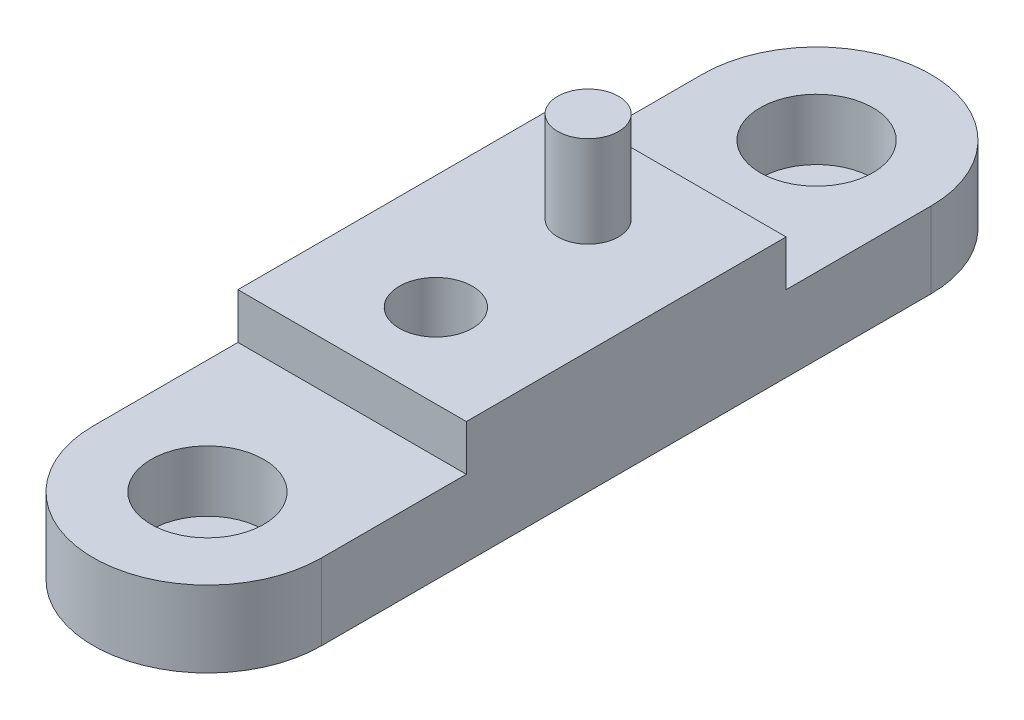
ISO-10303-21;
HEADER;
FILE_DESCRIPTION(('STEP AP214'),'2;1');
FILE_NAME('part.step','',(''),(''),'','','');
FILE_SCHEMA(('AUTOMOTIVE_DESIGN { 1 0 10303 214 1 1 1 1 }'));
ENDSEC;
DATA;
#1=APPLICATION_CONTEXT('core data for automotive mechanical design processes');
#2=APPLICATION_PROTOCOL_DEFINITION('international standard','automotive_design',2000,#1);
#3=PRODUCT_CONTEXT('',#1,'mechanical');
#4=PRODUCT('Part','Part','',(#3));
#5=PRODUCT_RELATED_PRODUCT_CATEGORY('part','',(#4));
#6=PRODUCT_DEFINITION_FORMATION('','',#4);
#7=PRODUCT_DEFINITION_CONTEXT('part definition',#1,'design');
#8=PRODUCT_DEFINITION('design','',#6,#7);
#9=PRODUCT_DEFINITION_SHAPE('','',#8);
#10=(LENGTH_UNIT() NAMED_UNIT(*) SI_UNIT(.MILLI.,.METRE.));
#11=(NAMED_UNIT(*) PLANE_ANGLE_UNIT() SI_UNIT($,.RADIAN.));
#12=(NAMED_UNIT(*) SI_UNIT($,.STERADIAN.) SOLID_ANGLE_UNIT());
#13=UNCERTAINTY_MEASURE_WITH_UNIT(LENGTH_MEASURE(1.E-05),#10,'distance_accuracy_value','');
#14=(GEOMETRIC_REPRESENTATION_CONTEXT(3) GLOBAL_UNCERTAINTY_ASSIGNED_CONTEXT((#13)) GLOBAL_UNIT_ASSIGNED_CONTEXT((#10,
#11,#12)) REPRESENTATION_CONTEXT('',''));
#15=CARTESIAN_POINT('',(0.,0.,0.));
#16=DIRECTION('',(0.,0.,1.));
#17=DIRECTION('',(1.,0.,0.));
#18=AXIS2_PLACEMENT_3D('',#15,#16,#17);
#19=CARTESIAN_POINT('',(0.,4.,0.));
#20=DIRECTION('',(0.,-1.,0.));
#21=DIRECTION('',(0.,0.,-1.));
#22=AXIS2_PLACEMENT_3D('',#19,#20,#21);
#23=CYLINDRICAL_SURFACE('',#22,3.75);
#24=CARTESIAN_POINT('',(0.,2.5,0.));
#25=DIRECTION('',(0.,1.,0.));
#26=DIRECTION('',(0.,0.,1.));
#27=AXIS2_PLACEMENT_3D('',#24,#25,#26);
#28=CIRCLE('',#27,3.75);
#29=CARTESIAN_POINT('',(3.75,2.5,0.));
#30=VERTEX_POINT('',#29);
#31=CARTESIAN_POINT('',(-3.75,2.5,0.));
#32=VERTEX_POINT('',#31);
#33=EDGE_CURVE('E159',#30,#32,#28,.T.);
#34=ORIENTED_EDGE('',*,*,#33,.F.);
#35=DIRECTION('',(0.,-1.,0.));
#36=VECTOR('',#35,1.);
#37=CARTESIAN_POINT('',(3.75,4.,0.));
#38=LINE('',#37,#36);
#39=CARTESIAN_POINT('',(3.75,0.,0.));
#40=VERTEX_POINT('',#39);
#41=EDGE_CURVE('E44',#30,#40,#38,.T.);
#42=ORIENTED_EDGE('',*,*,#41,.T.);
#43=CARTESIAN_POINT('',(0.,0.,0.));
#44=DIRECTION('',(0.,1.,0.));
#45=DIRECTION('',(0.,0.,1.));
#46=AXIS2_PLACEMENT_3D('',#43,#44,#45);
#47=CIRCLE('',#46,3.75);
#48=CARTESIAN_POINT('',(-3.75,0.,0.));
#49=VERTEX_POINT('',#48);
#50=EDGE_CURVE('E165',#40,#49,#47,.T.);
#51=ORIENTED_EDGE('',*,*,#50,.T.);
#52=DIRECTION('',(0.,-1.,0.));
#53=VECTOR('',#52,1.);
#54=CARTESIAN_POINT('',(-3.75,4.,0.));
#55=LINE('',#54,#53);
#56=EDGE_CURVE('E11',#32,#49,#55,.T.);
#57=ORIENTED_EDGE('',*,*,#56,.F.);
#58=EDGE_LOOP('',(#34,#42,#51,#57));
#59=FACE_BOUND('',#58,.T.);
#60=ADVANCED_FACE('F37',(#59),#23,.T.);
#61=CARTESIAN_POINT('',(-3.75,4.,0.));
#62=DIRECTION('',(1.,0.,0.));
#63=DIRECTION('',(0.,0.,-1.));
#64=AXIS2_PLACEMENT_3D('',#61,#62,#63);
#65=PLANE('',#64);
#66=DIRECTION('',(0.,0.,1.));
#67=VECTOR('',#66,1.);
#68=CARTESIAN_POINT('',(-3.75,4.,0.));
#69=LINE('',#68,#67);
#70=CARTESIAN_POINT('',(-3.75,4.,4.75));
#71=VERTEX_POINT('',#70);
#72=CARTESIAN_POINT('',(-3.75,4.,15.25));
#73=VERTEX_POINT('',#72);
#74=EDGE_CURVE('E167',#71,#73,#69,.T.);
#75=ORIENTED_EDGE('',*,*,#74,.F.);
#76=DIRECTION('',(0.,1.,0.));
#77=VECTOR('',#76,1.);
#78=CARTESIAN_POINT('',(-3.75,2.5,4.75));
#79=LINE('',#78,#77);
#80=CARTESIAN_POINT('',(-3.75,2.5,4.75));
#81=VERTEX_POINT('',#80);
#82=EDGE_CURVE('E51',#81,#71,#79,.T.);
#83=ORIENTED_EDGE('',*,*,#82,.F.);
#84=DIRECTION('',(0.,0.,1.));
#85=VECTOR('',#84,1.);
#86=CARTESIAN_POINT('',(-3.75,2.5,0.));
#87=LINE('',#86,#85);
#88=EDGE_CURVE('E151',#32,#81,#87,.T.);
#89=ORIENTED_EDGE('',*,*,#88,.F.);
#90=ORIENTED_EDGE('',*,*,#56,.T.);
#91=DIRECTION('',(0.,0.,1.));
#92=VECTOR('',#91,1.);
#93=CARTESIAN_POINT('',(-3.75,0.,0.));
#94=LINE('',#93,#92);
#95=CARTESIAN_POINT('',(-3.75,0.,20.));
#96=VERTEX_POINT('',#95);
#97=EDGE_CURVE('E174',#49,#96,#94,.T.);
#98=ORIENTED_EDGE('',*,*,#97,.T.);
#99=DIRECTION('',(0.,-1.,0.));
#100=VECTOR('',#99,1.);
#101=CARTESIAN_POINT('',(-3.75,4.,20.));
#102=LINE('',#101,#100);
#103=CARTESIAN_POINT('',(-3.75,2.5,20.));
#104=VERTEX_POINT('',#103);
#105=EDGE_CURVE('E125',#104,#96,#102,.T.);
#106=ORIENTED_EDGE('',*,*,#105,.F.);
#107=DIRECTION('',(0.,0.,-1.));
#108=VECTOR('',#107,1.);
#109=CARTESIAN_POINT('',(-3.75,2.5,20.));
#110=LINE('',#109,#108);
#111=CARTESIAN_POINT('',(-3.75,2.5,15.25));
#112=VERTEX_POINT('',#111);
#113=EDGE_CURVE('E105',#104,#112,#110,.T.);
#114=ORIENTED_EDGE('',*,*,#113,.T.);
#115=DIRECTION('',(0.,1.,0.));
#116=VECTOR('',#115,1.);
#117=CARTESIAN_POINT('',(-3.75,2.5,15.25));
#118=LINE('',#117,#116);
#119=EDGE_CURVE('E114',#112,#73,#118,.T.);
#120=ORIENTED_EDGE('',*,*,#119,.T.);
#121=EDGE_LOOP('',(#75,#83,#89,#90,#98,#106,#114,#120));
#122=FACE_BOUND('',#121,.T.);
#123=ADVANCED_FACE('F123',(#122),#65,.F.);
#124=CARTESIAN_POINT('',(3.75,4.,0.));
#125=DIRECTION('',(-1.,0.,0.));
#126=DIRECTION('',(0.,0.,1.));
#127=AXIS2_PLACEMENT_3D('',#124,#125,#126);
#128=PLANE('',#127);
#129=DIRECTION('',(0.,0.,-1.));
#130=VECTOR('',#129,1.);
#131=CARTESIAN_POINT('',(3.75,2.5,0.));
#132=LINE('',#131,#130);
#133=CARTESIAN_POINT('',(3.75,2.5,4.75));
#134=VERTEX_POINT('',#133);
#135=EDGE_CURVE('E157',#134,#30,#132,.T.);
#136=ORIENTED_EDGE('',*,*,#135,.F.);
#137=DIRECTION('',(0.,1.,0.));
#138=VECTOR('',#137,1.);
#139=CARTESIAN_POINT('',(3.75,2.5,4.75));
#140=LINE('',#139,#138);
#141=CARTESIAN_POINT('',(3.75,4.,4.75));
#142=VERTEX_POINT('',#141);
#143=EDGE_CURVE('E162',#134,#142,#140,.T.);
#144=ORIENTED_EDGE('',*,*,#143,.T.);
#145=DIRECTION('',(0.,0.,-1.));
#146=VECTOR('',#145,1.);
#147=CARTESIAN_POINT('',(3.75,4.,0.));
#148=LINE('',#147,#146);
#149=CARTESIAN_POINT('',(3.75,4.,15.25));
#150=VERTEX_POINT('',#149);
#151=EDGE_CURVE('E169',#150,#142,#148,.T.);
#152=ORIENTED_EDGE('',*,*,#151,.F.);
#153=DIRECTION('',(0.,1.,0.));
#154=VECTOR('',#153,1.);
#155=CARTESIAN_POINT('',(3.75,2.5,15.25));
#156=LINE('',#155,#154);
#157=CARTESIAN_POINT('',(3.75,2.5,15.25));
#158=VERTEX_POINT('',#157);
#159=EDGE_CURVE('E120',#158,#150,#156,.T.);
#160=ORIENTED_EDGE('',*,*,#159,.F.);
#161=DIRECTION('',(0.,0.,1.));
#162=VECTOR('',#161,1.);
#163=CARTESIAN_POINT('',(3.75,2.5,20.));
#164=LINE('',#163,#162);
#165=CARTESIAN_POINT('',(3.75,2.5,20.));
#166=VERTEX_POINT('',#165);
#167=EDGE_CURVE('E107',#158,#166,#164,.T.);
#168=ORIENTED_EDGE('',*,*,#167,.T.);
#169=DIRECTION('',(0.,-1.,0.));
#170=VECTOR('',#169,1.);
#171=CARTESIAN_POINT('',(3.75,4.,20.));
#172=LINE('',#171,#170);
#173=CARTESIAN_POINT('',(3.75,0.,20.));
#174=VERTEX_POINT('',#173);
#175=EDGE_CURVE('E140',#166,#174,#172,.T.);
#176=ORIENTED_EDGE('',*,*,#175,.T.);
#177=DIRECTION('',(0.,0.,-1.));
#178=VECTOR('',#177,1.);
#179=CARTESIAN_POINT('',(3.75,0.,0.));
#180=LINE('',#179,#178);
#181=EDGE_CURVE('E170',#174,#40,#180,.T.);
#182=ORIENTED_EDGE('',*,*,#181,.T.);
#183=ORIENTED_EDGE('',*,*,#41,.F.);
#184=EDGE_LOOP('',(#136,#144,#152,#160,#168,#176,#182,#183));
#185=FACE_BOUND('',#184,.T.);
#186=ADVANCED_FACE('F179',(#185),#128,.F.);
#187=CARTESIAN_POINT('',(0.,4.,0.));
#188=DIRECTION('',(0.,1.,0.));
#189=DIRECTION('',(0.,0.,1.));
#190=AXIS2_PLACEMENT_3D('',#187,#188,#189);
#191=PLANE('',#190);
#192=CARTESIAN_POINT('',(0.,4.,12.5));
#193=DIRECTION('',(0.,1.,0.));
#194=DIRECTION('',(0.,0.,1.));
#195=AXIS2_PLACEMENT_3D('',#192,#193,#194);
#196=CIRCLE('',#195,1.2);
#197=CARTESIAN_POINT('',(0.,4.,13.7));
#198=VERTEX_POINT('',#197);
#199=EDGE_CURVE('E350',#198,#198,#196,.T.);
#200=ORIENTED_EDGE('',*,*,#199,.F.);
#201=EDGE_LOOP('',(#200));
#202=FACE_BOUND('',#201,.T.);
#203=CARTESIAN_POINT('',(0.,4.,7.5));
#204=DIRECTION('',(0.,1.,0.));
#205=DIRECTION('',(0.,0.,1.));
#206=AXIS2_PLACEMENT_3D('',#203,#204,#205);
#207=CIRCLE('',#206,1.);
#208=CARTESIAN_POINT('',(0.,4.,8.5));
#209=VERTEX_POINT('',#208);
#210=EDGE_CURVE('E352',#209,#209,#207,.T.);
#211=ORIENTED_EDGE('',*,*,#210,.F.);
#212=EDGE_LOOP('',(#211));
#213=FACE_BOUND('',#212,.T.);
#214=DIRECTION('',(1.,0.,0.));
#215=VECTOR('',#214,1.);
#216=CARTESIAN_POINT('',(-3.75,4.,4.75));
#217=LINE('',#216,#215);
#218=EDGE_CURVE('E148',#71,#142,#217,.T.);
#219=ORIENTED_EDGE('',*,*,#218,.F.);
#220=ORIENTED_EDGE('',*,*,#74,.T.);
#221=DIRECTION('',(1.,0.,0.));
#222=VECTOR('',#221,1.);
#223=CARTESIAN_POINT('',(-3.75,4.,15.25));
#224=LINE('',#223,#222);
#225=EDGE_CURVE('E117',#73,#150,#224,.T.);
#226=ORIENTED_EDGE('',*,*,#225,.T.);
#227=ORIENTED_EDGE('',*,*,#151,.T.);
#228=EDGE_LOOP('',(#219,#220,#226,#227));
#229=FACE_BOUND('',#228,.T.);
#230=ADVANCED_FACE('F190',(#202,#213,#229),#191,.T.);
#231=CARTESIAN_POINT('',(0.,0.,0.));
#232=DIRECTION('',(0.,1.,0.));
#233=DIRECTION('',(0.,0.,1.));
#234=AXIS2_PLACEMENT_3D('',#231,#232,#233);
#235=PLANE('',#234);
#236=CARTESIAN_POINT('',(0.,0.,12.5));
#237=DIRECTION('',(0.,1.,0.));
#238=DIRECTION('',(0.,0.,1.));
#239=AXIS2_PLACEMENT_3D('',#236,#237,#238);
#240=CIRCLE('',#239,1.2);
#241=CARTESIAN_POINT('',(0.,0.,13.7));
#242=VERTEX_POINT('',#241);
#243=EDGE_CURVE('E347',#242,#242,#240,.T.);
#244=ORIENTED_EDGE('',*,*,#243,.T.);
#245=EDGE_LOOP('',(#244));
#246=FACE_BOUND('',#245,.T.);
#247=ORIENTED_EDGE('',*,*,#50,.F.);
#248=ORIENTED_EDGE('',*,*,#181,.F.);
#249=CARTESIAN_POINT('',(0.,0.,20.));
#250=DIRECTION('',(0.,-1.,0.));
#251=DIRECTION('',(0.,0.,-1.));
#252=AXIS2_PLACEMENT_3D('',#249,#250,#251);
#253=CIRCLE('',#252,3.75);
#254=EDGE_CURVE('E136',#174,#96,#253,.T.);
#255=ORIENTED_EDGE('',*,*,#254,.T.);
#256=ORIENTED_EDGE('',*,*,#97,.F.);
#257=EDGE_LOOP('',(#247,#248,#255,#256));
#258=FACE_BOUND('',#257,.T.);
#259=ADVANCED_FACE('F184',(#246,#258),#235,.F.);
#260=CARTESIAN_POINT('',(-3.75,2.5,4.75));
#261=DIRECTION('',(0.,0.,1.));
#262=DIRECTION('',(1.,0.,0.));
#263=AXIS2_PLACEMENT_3D('',#260,#261,#262);
#264=PLANE('',#263);
#265=ORIENTED_EDGE('',*,*,#218,.T.);
#266=ORIENTED_EDGE('',*,*,#143,.F.);
#267=DIRECTION('',(1.,0.,0.));
#268=VECTOR('',#267,1.);
#269=CARTESIAN_POINT('',(-3.75,2.5,4.75));
#270=LINE('',#269,#268);
#271=EDGE_CURVE('E154',#81,#134,#270,.T.);
#272=ORIENTED_EDGE('',*,*,#271,.F.);
#273=ORIENTED_EDGE('',*,*,#82,.T.);
#274=EDGE_LOOP('',(#265,#266,#272,#273));
#275=FACE_BOUND('',#274,.T.);
#276=ADVANCED_FACE('F215',(#275),#264,.F.);
#277=CARTESIAN_POINT('',(0.,2.5,0.));
#278=DIRECTION('',(0.,1.,0.));
#279=DIRECTION('',(0.,0.,1.));
#280=AXIS2_PLACEMENT_3D('',#277,#278,#279);
#281=PLANE('',#280);
#282=CARTESIAN_POINT('',(0.,2.5,0.));
#283=DIRECTION('',(0.,1.,0.));
#284=DIRECTION('',(0.,0.,1.));
#285=AXIS2_PLACEMENT_3D('',#282,#283,#284);
#286=CIRCLE('',#285,1.85);
#287=CARTESIAN_POINT('',(0.,2.5,1.85));
#288=VERTEX_POINT('',#287);
#289=EDGE_CURVE('E144',#288,#288,#286,.T.);
#290=ORIENTED_EDGE('',*,*,#289,.F.);
#291=EDGE_LOOP('',(#290));
#292=FACE_BOUND('',#291,.T.);
#293=ORIENTED_EDGE('',*,*,#88,.T.);
#294=ORIENTED_EDGE('',*,*,#271,.T.);
#295=ORIENTED_EDGE('',*,*,#135,.T.);
#296=ORIENTED_EDGE('',*,*,#33,.T.);
#297=EDGE_LOOP('',(#293,#294,#295,#296));
#298=FACE_BOUND('',#297,.T.);
#299=ADVANCED_FACE('F188',(#292,#298),#281,.T.);
#300=CARTESIAN_POINT('',(0.,0.5,0.));
#301=DIRECTION('',(0.,1.,0.));
#302=DIRECTION('',(0.,0.,1.));
#303=AXIS2_PLACEMENT_3D('',#300,#301,#302);
#304=CYLINDRICAL_SURFACE('',#303,1.85);
#305=CARTESIAN_POINT('',(0.,0.5,0.));
#306=DIRECTION('',(0.,1.,0.));
#307=DIRECTION('',(0.,0.,1.));
#308=AXIS2_PLACEMENT_3D('',#305,#306,#307);
#309=CIRCLE('',#308,1.85);
#310=CARTESIAN_POINT('',(0.,0.5,1.85));
#311=VERTEX_POINT('',#310);
#312=EDGE_CURVE('E145',#311,#311,#309,.T.);
#313=ORIENTED_EDGE('',*,*,#312,.F.);
#314=EDGE_LOOP('',(#313));
#315=FACE_BOUND('',#314,.T.);
#316=ORIENTED_EDGE('',*,*,#289,.T.);
#317=EDGE_LOOP('',(#316));
#318=FACE_BOUND('',#317,.T.);
#319=ADVANCED_FACE('F201',(#315,#318),#304,.F.);
#320=CARTESIAN_POINT('',(0.,0.5,0.));
#321=DIRECTION('',(0.,1.,0.));
#322=DIRECTION('',(0.,0.,1.));
#323=AXIS2_PLACEMENT_3D('',#320,#321,#322);
#324=PLANE('',#323);
#325=ORIENTED_EDGE('',*,*,#312,.T.);
#326=EDGE_LOOP('',(#325));
#327=FACE_BOUND('',#326,.T.);
#328=ADVANCED_FACE('F194',(#327),#324,.T.);
#329=CARTESIAN_POINT('',(0.,4.,20.));
#330=DIRECTION('',(0.,-1.,0.));
#331=DIRECTION('',(0.,0.,1.));
#332=AXIS2_PLACEMENT_3D('',#329,#330,#331);
#333=CYLINDRICAL_SURFACE('',#332,3.75);
#334=CARTESIAN_POINT('',(0.,2.5,20.));
#335=DIRECTION('',(0.,-1.,0.));
#336=DIRECTION('',(0.,0.,-1.));
#337=AXIS2_PLACEMENT_3D('',#334,#335,#336);
#338=CIRCLE('',#337,3.75);
#339=EDGE_CURVE('E121',#166,#104,#338,.T.);
#340=ORIENTED_EDGE('',*,*,#339,.T.);
#341=ORIENTED_EDGE('',*,*,#105,.T.);
#342=ORIENTED_EDGE('',*,*,#254,.F.);
#343=ORIENTED_EDGE('',*,*,#175,.F.);
#344=EDGE_LOOP('',(#340,#341,#342,#343));
#345=FACE_BOUND('',#344,.T.);
#346=ADVANCED_FACE('F192',(#345),#333,.T.);
#347=CARTESIAN_POINT('',(-3.75,2.5,15.25));
#348=DIRECTION('',(0.,0.,-1.));
#349=DIRECTION('',(1.,0.,0.));
#350=AXIS2_PLACEMENT_3D('',#347,#348,#349);
#351=PLANE('',#350);
#352=ORIENTED_EDGE('',*,*,#225,.F.);
#353=ORIENTED_EDGE('',*,*,#119,.F.);
#354=DIRECTION('',(1.,0.,0.));
#355=VECTOR('',#354,1.);
#356=CARTESIAN_POINT('',(-3.75,2.5,15.25));
#357=LINE('',#356,#355);
#358=EDGE_CURVE('E100',#112,#158,#357,.T.);
#359=ORIENTED_EDGE('',*,*,#358,.T.);
#360=ORIENTED_EDGE('',*,*,#159,.T.);
#361=EDGE_LOOP('',(#352,#353,#359,#360));
#362=FACE_BOUND('',#361,.T.);
#363=ADVANCED_FACE('F115',(#362),#351,.F.);
#364=CARTESIAN_POINT('',(0.,2.5,20.));
#365=DIRECTION('',(0.,1.,0.));
#366=DIRECTION('',(0.,0.,-1.));
#367=AXIS2_PLACEMENT_3D('',#364,#365,#366);
#368=PLANE('',#367);
#369=CARTESIAN_POINT('',(0.,2.5,20.));
#370=DIRECTION('',(0.,-1.,0.));
#371=DIRECTION('',(0.,0.,-1.));
#372=AXIS2_PLACEMENT_3D('',#369,#370,#371);
#373=CIRCLE('',#372,1.85);
#374=CARTESIAN_POINT('',(0.,2.5,18.15));
#375=VERTEX_POINT('',#374);
#376=EDGE_CURVE('E131',#375,#375,#373,.T.);
#377=ORIENTED_EDGE('',*,*,#376,.T.);
#378=EDGE_LOOP('',(#377));
#379=FACE_BOUND('',#378,.T.);
#380=ORIENTED_EDGE('',*,*,#113,.F.);
#381=ORIENTED_EDGE('',*,*,#339,.F.);
#382=ORIENTED_EDGE('',*,*,#167,.F.);
#383=ORIENTED_EDGE('',*,*,#358,.F.);
#384=EDGE_LOOP('',(#380,#381,#382,#383));
#385=FACE_BOUND('',#384,.T.);
#386=ADVANCED_FACE('F102',(#379,#385),#368,.T.);
#387=CARTESIAN_POINT('',(0.,0.5,20.));
#388=DIRECTION('',(0.,1.,0.));
#389=DIRECTION('',(0.,0.,-1.));
#390=AXIS2_PLACEMENT_3D('',#387,#388,#389);
#391=CYLINDRICAL_SURFACE('',#390,1.85);
#392=CARTESIAN_POINT('',(0.,0.5,20.));
#393=DIRECTION('',(0.,-1.,0.));
#394=DIRECTION('',(0.,0.,-1.));
#395=AXIS2_PLACEMENT_3D('',#392,#393,#394);
#396=CIRCLE('',#395,1.85);
#397=CARTESIAN_POINT('',(0.,0.5,18.15));
#398=VERTEX_POINT('',#397);
#399=EDGE_CURVE('E128',#398,#398,#396,.T.);
#400=ORIENTED_EDGE('',*,*,#399,.T.);
#401=EDGE_LOOP('',(#400));
#402=FACE_BOUND('',#401,.T.);
#403=ORIENTED_EDGE('',*,*,#376,.F.);
#404=EDGE_LOOP('',(#403));
#405=FACE_BOUND('',#404,.T.);
#406=ADVANCED_FACE('F292',(#402,#405),#391,.F.);
#407=CARTESIAN_POINT('',(0.,0.5,20.));
#408=DIRECTION('',(0.,1.,0.));
#409=DIRECTION('',(0.,0.,-1.));
#410=AXIS2_PLACEMENT_3D('',#407,#408,#409);
#411=PLANE('',#410);
#412=ORIENTED_EDGE('',*,*,#399,.F.);
#413=EDGE_LOOP('',(#412));
#414=FACE_BOUND('',#413,.T.);
#415=ADVANCED_FACE('F301',(#414),#411,.T.);
#416=CARTESIAN_POINT('',(0.,7.,7.5));
#417=DIRECTION('',(0.,-1.,0.));
#418=DIRECTION('',(0.,0.,-1.));
#419=AXIS2_PLACEMENT_3D('',#416,#417,#418);
#420=CYLINDRICAL_SURFACE('',#419,1.);
#421=CARTESIAN_POINT('',(0.,7.,7.5));
#422=DIRECTION('',(0.,1.,0.));
#423=DIRECTION('',(0.,0.,1.));
#424=AXIS2_PLACEMENT_3D('',#421,#422,#423);
#425=CIRCLE('',#424,1.);
#426=CARTESIAN_POINT('',(0.,7.,8.5));
#427=VERTEX_POINT('',#426);
#428=EDGE_CURVE('E355',#427,#427,#425,.T.);
#429=ORIENTED_EDGE('',*,*,#428,.F.);
#430=EDGE_LOOP('',(#429));
#431=FACE_BOUND('',#430,.T.);
#432=ORIENTED_EDGE('',*,*,#210,.T.);
#433=EDGE_LOOP('',(#432));
#434=FACE_BOUND('',#433,.T.);
#435=ADVANCED_FACE('F310',(#431,#434),#420,.T.);
#436=CARTESIAN_POINT('',(0.,7.,7.5));
#437=DIRECTION('',(0.,1.,0.));
#438=DIRECTION('',(0.,0.,1.));
#439=AXIS2_PLACEMENT_3D('',#436,#437,#438);
#440=PLANE('',#439);
#441=ORIENTED_EDGE('',*,*,#428,.T.);
#442=EDGE_LOOP('',(#441));
#443=FACE_BOUND('',#442,.T.);
#444=ADVANCED_FACE('F319',(#443),#440,.T.);
#445=CARTESIAN_POINT('',(0.,0.,12.5));
#446=DIRECTION('',(0.,1.,0.));
#447=DIRECTION('',(0.,0.,1.));
#448=AXIS2_PLACEMENT_3D('',#445,#446,#447);
#449=CYLINDRICAL_SURFACE('',#448,1.2);
#450=ORIENTED_EDGE('',*,*,#243,.F.);
#451=EDGE_LOOP('',(#450));
#452=FACE_BOUND('',#451,.T.);
#453=ORIENTED_EDGE('',*,*,#199,.T.);
#454=EDGE_LOOP('',(#453));
#455=FACE_BOUND('',#454,.T.);
#456=ADVANCED_FACE('F327',(#452,#455),#449,.F.);
#457=CLOSED_SHELL('',(#60,#123,#186,#230,#259,#276,#299,#319,#328,#346,#363,#386,#406,#415,#435,
#444,#456));
#458=MANIFOLD_SOLID_BREP('B2',#457);
#459=ADVANCED_BREP_SHAPE_REPRESENTATION('',(#18,#458),#14);
#460=SHAPE_DEFINITION_REPRESENTATION(#9,#459);
ENDSEC;
END-ISO-10303-21;
